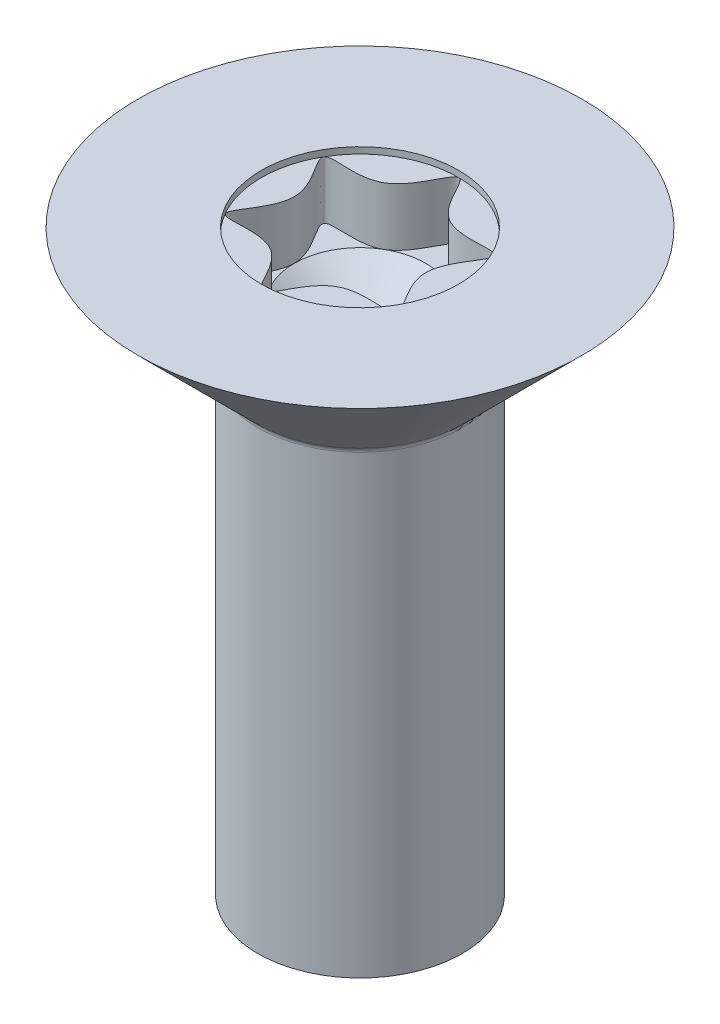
ISO-10303-21;
HEADER;
FILE_DESCRIPTION(('STEP AP214'),'2;1');
FILE_NAME('part.step','',(''),(''),'','','');
FILE_SCHEMA(('AUTOMOTIVE_DESIGN { 1 0 10303 214 1 1 1 1 }'));
ENDSEC;
DATA;
#1=APPLICATION_CONTEXT('core data for automotive mechanical design processes');
#2=APPLICATION_PROTOCOL_DEFINITION('international standard','automotive_design',2000,#1);
#3=PRODUCT_CONTEXT('',#1,'mechanical');
#4=PRODUCT('Part','Part','',(#3));
#5=PRODUCT_RELATED_PRODUCT_CATEGORY('part','',(#4));
#6=PRODUCT_DEFINITION_FORMATION('','',#4);
#7=PRODUCT_DEFINITION_CONTEXT('part definition',#1,'design');
#8=PRODUCT_DEFINITION('design','',#6,#7);
#9=PRODUCT_DEFINITION_SHAPE('','',#8);
#10=(LENGTH_UNIT() NAMED_UNIT(*) SI_UNIT(.MILLI.,.METRE.));
#11=(NAMED_UNIT(*) PLANE_ANGLE_UNIT() SI_UNIT($,.RADIAN.));
#12=(NAMED_UNIT(*) SI_UNIT($,.STERADIAN.) SOLID_ANGLE_UNIT());
#13=UNCERTAINTY_MEASURE_WITH_UNIT(LENGTH_MEASURE(1.E-05),#10,'distance_accuracy_value','');
#14=(GEOMETRIC_REPRESENTATION_CONTEXT(3) GLOBAL_UNCERTAINTY_ASSIGNED_CONTEXT((#13)) GLOBAL_UNIT_ASSIGNED_CONTEXT((#10,
#11,#12)) REPRESENTATION_CONTEXT('',''));
#15=CARTESIAN_POINT('',(0.,0.,0.));
#16=DIRECTION('',(0.,0.,1.));
#17=DIRECTION('',(1.,0.,0.));
#18=AXIS2_PLACEMENT_3D('',#15,#16,#17);
#19=CARTESIAN_POINT('',(0.,7.29,1.4));
#20=DIRECTION('',(0.,1.,0.));
#21=DIRECTION('',(0.,0.,1.));
#22=AXIS2_PLACEMENT_3D('',#19,#20,#21);
#23=PLANE('',#22);
#24=CARTESIAN_POINT('',(0.,7.29,-1.4));
#25=CARTESIAN_POINT('',(0.100650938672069,7.29,-1.4));
#26=CARTESIAN_POINT('',(0.301952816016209,7.29,-0.522997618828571));
#27=CARTESIAN_POINT('',(1.59218873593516,7.29,-0.919250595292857));
#28=CARTESIAN_POINT('',(0.603905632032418,7.29,0.));
#29=CARTESIAN_POINT('',(1.59218873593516,7.29,0.919250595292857));
#30=CARTESIAN_POINT('',(0.301952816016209,7.29,0.52299761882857));
#31=CARTESIAN_POINT('',(0.,7.29,1.83850119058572));
#32=CARTESIAN_POINT('',(-0.301952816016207,7.29,0.522997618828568));
#33=CARTESIAN_POINT('',(-1.59218873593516,7.29,0.919250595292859));
#34=CARTESIAN_POINT('',(-0.603905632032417,7.29,0.));
#35=CARTESIAN_POINT('',(-1.59218873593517,7.29,-0.919250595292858));
#36=CARTESIAN_POINT('',(-0.301952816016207,7.29,-0.52299761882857));
#37=CARTESIAN_POINT('',(-0.100650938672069,7.29,-1.4));
#38=CARTESIAN_POINT('',(0.,7.29,-1.4));
#39=B_SPLINE_CURVE_WITH_KNOTS('',3,(#24,#25,#26,#27,#28,#29,#30,#31,#32,#33,#34,#35,#36,#37,
#38),.UNSPECIFIED.,.T.,.F.,(4,1,1,1,1,1,1,1,1,1,1,1,4),(0.,0.0833333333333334,0.166666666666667,
0.25,0.333333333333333,0.416666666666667,0.5,0.583333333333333,0.666666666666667,0.75,
0.833333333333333,0.916666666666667,1.),.UNSPECIFIED.);
#40=CARTESIAN_POINT('',(0.466666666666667,7.29,-0.808290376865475));
#41=VERTEX_POINT('',#40);
#42=CARTESIAN_POINT('',(0.933333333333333,7.29,0.));
#43=VERTEX_POINT('',#42);
#44=EDGE_CURVE('E133',#41,#43,#39,.T.);
#45=ORIENTED_EDGE('',*,*,#44,.F.);
#46=CARTESIAN_POINT('',(0.,7.29,0.));
#47=DIRECTION('',(0.,-1.,0.));
#48=DIRECTION('',(0.,0.,-1.));
#49=AXIS2_PLACEMENT_3D('',#46,#47,#48);
#50=CIRCLE('',#49,0.933333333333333);
#51=EDGE_CURVE('E48',#41,#43,#50,.T.);
#52=ORIENTED_EDGE('',*,*,#51,.T.);
#53=EDGE_LOOP('',(#45,#52));
#54=FACE_BOUND('',#53,.T.);
#55=ADVANCED_FACE('F33',(#54),#23,.T.);
#56=CARTESIAN_POINT('',(0.466666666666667,7.29,0.808290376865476));
#57=VERTEX_POINT('',#56);
#58=EDGE_CURVE('E148',#43,#57,#39,.T.);
#59=ORIENTED_EDGE('',*,*,#58,.F.);
#60=EDGE_CURVE('E187',#43,#57,#50,.T.);
#61=ORIENTED_EDGE('',*,*,#60,.T.);
#62=EDGE_LOOP('',(#59,#61));
#63=FACE_BOUND('',#62,.T.);
#64=ADVANCED_FACE('F101',(#63),#23,.T.);
#65=CARTESIAN_POINT('',(-0.466666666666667,7.29,0.808290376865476));
#66=VERTEX_POINT('',#65);
#67=EDGE_CURVE('E141',#57,#66,#39,.T.);
#68=ORIENTED_EDGE('',*,*,#67,.F.);
#69=EDGE_CURVE('E190',#57,#66,#50,.T.);
#70=ORIENTED_EDGE('',*,*,#69,.T.);
#71=EDGE_LOOP('',(#68,#70));
#72=FACE_BOUND('',#71,.T.);
#73=ADVANCED_FACE('F108',(#72),#23,.T.);
#74=CARTESIAN_POINT('',(-0.933333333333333,7.29,0.));
#75=VERTEX_POINT('',#74);
#76=EDGE_CURVE('E139',#66,#75,#39,.T.);
#77=ORIENTED_EDGE('',*,*,#76,.F.);
#78=EDGE_CURVE('E195',#66,#75,#50,.T.);
#79=ORIENTED_EDGE('',*,*,#78,.T.);
#80=EDGE_LOOP('',(#77,#79));
#81=FACE_BOUND('',#80,.T.);
#82=ADVANCED_FACE('F122',(#81),#23,.T.);
#83=CARTESIAN_POINT('',(-0.466666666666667,7.29,-0.808290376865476));
#84=VERTEX_POINT('',#83);
#85=EDGE_CURVE('E130',#75,#84,#39,.T.);
#86=ORIENTED_EDGE('',*,*,#85,.F.);
#87=EDGE_CURVE('E198',#75,#84,#50,.T.);
#88=ORIENTED_EDGE('',*,*,#87,.T.);
#89=EDGE_LOOP('',(#86,#88));
#90=FACE_BOUND('',#89,.T.);
#91=ADVANCED_FACE('F114',(#90),#23,.T.);
#92=EDGE_CURVE('E126',#84,#41,#39,.T.);
#93=ORIENTED_EDGE('',*,*,#92,.F.);
#94=EDGE_CURVE('E128',#84,#41,#50,.T.);
#95=ORIENTED_EDGE('',*,*,#94,.T.);
#96=EDGE_LOOP('',(#93,#95));
#97=FACE_BOUND('',#96,.T.);
#98=ADVANCED_FACE('F104',(#97),#23,.T.);
#99=CARTESIAN_POINT('',(0.,8.2,0.));
#100=DIRECTION('',(0.,1.,0.));
#101=DIRECTION('',(0.,0.,1.));
#102=AXIS2_PLACEMENT_3D('',#99,#100,#101);
#103=PLANE('',#102);
#104=CARTESIAN_POINT('',(0.,8.2,0.));
#105=DIRECTION('',(0.,1.,0.));
#106=DIRECTION('',(0.,0.,1.));
#107=AXIS2_PLACEMENT_3D('',#104,#105,#106);
#108=CIRCLE('',#107,1.4);
#109=CARTESIAN_POINT('',(0.,8.2,1.4));
#110=VERTEX_POINT('',#109);
#111=EDGE_CURVE('E149',#110,#110,#108,.T.);
#112=ORIENTED_EDGE('',*,*,#111,.F.);
#113=EDGE_LOOP('',(#112));
#114=FACE_BOUND('',#113,.T.);
#115=CARTESIAN_POINT('',(0.,8.2,0.));
#116=DIRECTION('',(0.,-1.,0.));
#117=DIRECTION('',(0.,0.,-1.));
#118=AXIS2_PLACEMENT_3D('',#115,#116,#117);
#119=CIRCLE('',#118,3.15);
#120=CARTESIAN_POINT('',(0.,8.2,-3.15));
#121=VERTEX_POINT('',#120);
#122=EDGE_CURVE('E173',#121,#121,#119,.T.);
#123=ORIENTED_EDGE('',*,*,#122,.F.);
#124=EDGE_LOOP('',(#123));
#125=FACE_BOUND('',#124,.T.);
#126=ADVANCED_FACE('F113',(#114,#125),#103,.T.);
#127=CARTESIAN_POINT('',(0.,6.5,0.));
#128=DIRECTION('',(0.,1.,0.));
#129=DIRECTION('',(0.,0.,1.));
#130=AXIS2_PLACEMENT_3D('',#127,#128,#129);
#131=CONICAL_SURFACE('',#130,1.44999999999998,0.785398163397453);
#132=CARTESIAN_POINT('',(0.,6.52928932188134,0.));
#133=DIRECTION('',(0.,1.,0.));
#134=DIRECTION('',(0.,0.,1.));
#135=AXIS2_PLACEMENT_3D('',#132,#133,#134);
#136=CIRCLE('',#135,1.47928932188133);
#137=CARTESIAN_POINT('',(0.,6.52928932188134,1.47928932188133));
#138=VERTEX_POINT('',#137);
#139=EDGE_CURVE('E11',#138,#138,#136,.T.);
#140=ORIENTED_EDGE('',*,*,#139,.T.);
#141=EDGE_LOOP('',(#140));
#142=FACE_BOUND('',#141,.T.);
#143=ORIENTED_EDGE('',*,*,#122,.T.);
#144=EDGE_LOOP('',(#143));
#145=FACE_BOUND('',#144,.T.);
#146=ADVANCED_FACE('F120',(#142,#145),#131,.T.);
#147=CARTESIAN_POINT('',(0.,0.,0.));
#148=DIRECTION('',(0.,-1.,0.));
#149=DIRECTION('',(0.,0.,-1.));
#150=AXIS2_PLACEMENT_3D('',#147,#148,#149);
#151=CYLINDRICAL_SURFACE('',#150,1.44999999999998);
#152=CARTESIAN_POINT('',(0.,6.45857864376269,0.));
#153=DIRECTION('',(0.,-1.,0.));
#154=DIRECTION('',(0.,0.,-1.));
#155=AXIS2_PLACEMENT_3D('',#152,#153,#154);
#156=CIRCLE('',#155,1.44999999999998);
#157=CARTESIAN_POINT('',(0.,6.45857864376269,-1.44999999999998));
#158=VERTEX_POINT('',#157);
#159=EDGE_CURVE('E41',#158,#158,#156,.T.);
#160=ORIENTED_EDGE('',*,*,#159,.T.);
#161=EDGE_LOOP('',(#160));
#162=FACE_BOUND('',#161,.T.);
#163=CARTESIAN_POINT('',(0.,0.,0.));
#164=DIRECTION('',(0.,-1.,0.));
#165=DIRECTION('',(0.,0.,-1.));
#166=AXIS2_PLACEMENT_3D('',#163,#164,#165);
#167=CIRCLE('',#166,1.44999999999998);
#168=CARTESIAN_POINT('',(0.,0.,-1.44999999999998));
#169=VERTEX_POINT('',#168);
#170=EDGE_CURVE('E147',#169,#169,#167,.T.);
#171=ORIENTED_EDGE('',*,*,#170,.F.);
#172=EDGE_LOOP('',(#171));
#173=FACE_BOUND('',#172,.T.);
#174=ADVANCED_FACE('F160',(#162,#173),#151,.T.);
#175=CARTESIAN_POINT('',(1.44999999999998,0.,0.));
#176=DIRECTION('',(0.,-1.,0.));
#177=DIRECTION('',(0.,0.,-1.));
#178=AXIS2_PLACEMENT_3D('',#175,#176,#177);
#179=PLANE('',#178);
#180=ORIENTED_EDGE('',*,*,#170,.T.);
#181=EDGE_LOOP('',(#180));
#182=FACE_BOUND('',#181,.T.);
#183=ADVANCED_FACE('F156',(#182),#179,.T.);
#184=CARTESIAN_POINT('',(0.,8.109,0.));
#185=DIRECTION('',(0.,1.,0.));
#186=DIRECTION('',(0.,0.,1.));
#187=AXIS2_PLACEMENT_3D('',#184,#185,#186);
#188=CYLINDRICAL_SURFACE('',#187,1.4);
#189=ORIENTED_EDGE('',*,*,#111,.T.);
#190=EDGE_LOOP('',(#189));
#191=FACE_BOUND('',#190,.T.);
#192=CARTESIAN_POINT('',(0.,8.109,0.));
#193=DIRECTION('',(0.,1.,0.));
#194=DIRECTION('',(0.,0.,1.));
#195=AXIS2_PLACEMENT_3D('',#192,#193,#194);
#196=CIRCLE('',#195,1.4);
#197=CARTESIAN_POINT('',(1.21243556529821,8.109,0.699999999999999));
#198=VERTEX_POINT('',#197);
#199=CARTESIAN_POINT('',(1.21243556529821,8.109,-0.7));
#200=VERTEX_POINT('',#199);
#201=EDGE_CURVE('E212',#198,#200,#196,.T.);
#202=ORIENTED_EDGE('',*,*,#201,.F.);
#203=CARTESIAN_POINT('',(0.,8.109,1.4));
#204=VERTEX_POINT('',#203);
#205=EDGE_CURVE('E131',#204,#198,#196,.T.);
#206=ORIENTED_EDGE('',*,*,#205,.F.);
#207=CARTESIAN_POINT('',(-1.21243556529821,8.109,0.7));
#208=VERTEX_POINT('',#207);
#209=EDGE_CURVE('E197',#208,#204,#196,.T.);
#210=ORIENTED_EDGE('',*,*,#209,.F.);
#211=CARTESIAN_POINT('',(-1.21243556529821,8.109,-0.7));
#212=VERTEX_POINT('',#211);
#213=EDGE_CURVE('E220',#212,#208,#196,.T.);
#214=ORIENTED_EDGE('',*,*,#213,.F.);
#215=CARTESIAN_POINT('',(0.,8.109,-1.4));
#216=VERTEX_POINT('',#215);
#217=EDGE_CURVE('E223',#216,#212,#196,.T.);
#218=ORIENTED_EDGE('',*,*,#217,.F.);
#219=EDGE_CURVE('E55',#200,#216,#196,.T.);
#220=ORIENTED_EDGE('',*,*,#219,.F.);
#221=EDGE_LOOP('',(#202,#206,#210,#214,#218,#220));
#222=FACE_BOUND('',#221,.T.);
#223=ADVANCED_FACE('F159',(#191,#222),#188,.F.);
#224=CARTESIAN_POINT('',(0.,8.109,0.));
#225=DIRECTION('',(0.,1.,0.));
#226=DIRECTION('',(0.,0.,1.));
#227=AXIS2_PLACEMENT_3D('',#224,#225,#226);
#228=PLANE('',#227);
#229=ORIENTED_EDGE('',*,*,#217,.T.);
#230=CARTESIAN_POINT('',(0.,8.109,-1.4));
#231=CARTESIAN_POINT('',(0.100650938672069,8.109,-1.4));
#232=CARTESIAN_POINT('',(0.301952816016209,8.109,-0.522997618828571));
#233=CARTESIAN_POINT('',(1.59218873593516,8.109,-0.919250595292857));
#234=CARTESIAN_POINT('',(0.603905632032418,8.109,0.));
#235=CARTESIAN_POINT('',(1.59218873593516,8.109,0.919250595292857));
#236=CARTESIAN_POINT('',(0.301952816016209,8.109,0.52299761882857));
#237=CARTESIAN_POINT('',(0.,8.109,1.83850119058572));
#238=CARTESIAN_POINT('',(-0.301952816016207,8.109,0.522997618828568));
#239=CARTESIAN_POINT('',(-1.59218873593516,8.109,0.919250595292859));
#240=CARTESIAN_POINT('',(-0.603905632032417,8.109,0.));
#241=CARTESIAN_POINT('',(-1.59218873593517,8.109,-0.919250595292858));
#242=CARTESIAN_POINT('',(-0.301952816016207,8.109,-0.52299761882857));
#243=CARTESIAN_POINT('',(-0.100650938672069,8.109,-1.4));
#244=CARTESIAN_POINT('',(0.,8.109,-1.4));
#245=B_SPLINE_CURVE_WITH_KNOTS('',3,(#230,#231,#232,#233,#234,#235,#236,#237,#238,#239,#240,
#241,#242,#243,#244),.UNSPECIFIED.,.T.,.F.,(4,1,1,1,1,1,1,1,1,1,1,1,4),(0.,0.0833333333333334,
0.166666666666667,0.25,0.333333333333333,0.416666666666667,0.5,0.583333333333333,
0.666666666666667,0.75,0.833333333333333,0.916666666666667,1.),.UNSPECIFIED.);
#246=EDGE_CURVE('E179',#216,#212,#245,.F.);
#247=ORIENTED_EDGE('',*,*,#246,.F.);
#248=EDGE_LOOP('',(#229,#247));
#249=FACE_BOUND('',#248,.T.);
#250=ADVANCED_FACE('F228',(#249),#228,.T.);
#251=ORIENTED_EDGE('',*,*,#213,.T.);
#252=EDGE_CURVE('E200',#212,#208,#245,.F.);
#253=ORIENTED_EDGE('',*,*,#252,.F.);
#254=EDGE_LOOP('',(#251,#253));
#255=FACE_BOUND('',#254,.T.);
#256=ADVANCED_FACE('F230',(#255),#228,.T.);
#257=ORIENTED_EDGE('',*,*,#209,.T.);
#258=EDGE_CURVE('E203',#208,#204,#245,.F.);
#259=ORIENTED_EDGE('',*,*,#258,.F.);
#260=EDGE_LOOP('',(#257,#259));
#261=FACE_BOUND('',#260,.T.);
#262=ADVANCED_FACE('F235',(#261),#228,.T.);
#263=ORIENTED_EDGE('',*,*,#205,.T.);
#264=EDGE_CURVE('E205',#204,#198,#245,.F.);
#265=ORIENTED_EDGE('',*,*,#264,.F.);
#266=EDGE_LOOP('',(#263,#265));
#267=FACE_BOUND('',#266,.T.);
#268=ADVANCED_FACE('F218',(#267),#228,.T.);
#269=ORIENTED_EDGE('',*,*,#201,.T.);
#270=EDGE_CURVE('E177',#198,#200,#245,.F.);
#271=ORIENTED_EDGE('',*,*,#270,.F.);
#272=EDGE_LOOP('',(#269,#271));
#273=FACE_BOUND('',#272,.T.);
#274=ADVANCED_FACE('F211',(#273),#228,.T.);
#275=ORIENTED_EDGE('',*,*,#219,.T.);
#276=EDGE_CURVE('E175',#200,#216,#245,.F.);
#277=ORIENTED_EDGE('',*,*,#276,.F.);
#278=EDGE_LOOP('',(#275,#277));
#279=FACE_BOUND('',#278,.T.);
#280=ADVANCED_FACE('F96',(#279),#228,.T.);
#281=DIRECTION('',(0.,1.,0.));
#282=VECTOR('',#281,1.);
#283=SURFACE_OF_LINEAR_EXTRUSION('',#39,#282);
#284=ORIENTED_EDGE('',*,*,#44,.T.);
#285=ORIENTED_EDGE('',*,*,#58,.T.);
#286=ORIENTED_EDGE('',*,*,#67,.T.);
#287=ORIENTED_EDGE('',*,*,#76,.T.);
#288=ORIENTED_EDGE('',*,*,#85,.T.);
#289=ORIENTED_EDGE('',*,*,#92,.T.);
#290=EDGE_LOOP('',(#284,#285,#286,#287,#288,#289));
#291=FACE_BOUND('',#290,.T.);
#292=ORIENTED_EDGE('',*,*,#276,.T.);
#293=ORIENTED_EDGE('',*,*,#246,.T.);
#294=ORIENTED_EDGE('',*,*,#252,.T.);
#295=ORIENTED_EDGE('',*,*,#258,.T.);
#296=ORIENTED_EDGE('',*,*,#264,.T.);
#297=ORIENTED_EDGE('',*,*,#270,.T.);
#298=EDGE_LOOP('',(#292,#293,#294,#295,#296,#297));
#299=FACE_BOUND('',#298,.T.);
#300=ADVANCED_FACE('F89',(#291,#299),#283,.T.);
#301=CARTESIAN_POINT('',(0.,6.67,0.));
#302=DIRECTION('',(0.,1.,0.));
#303=DIRECTION('',(0.,0.,1.));
#304=AXIS2_PLACEMENT_3D('',#301,#302,#303);
#305=CONICAL_SURFACE('',#304,0.,0.984443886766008);
#306=ORIENTED_EDGE('',*,*,#51,.F.);
#307=ORIENTED_EDGE('',*,*,#94,.F.);
#308=ORIENTED_EDGE('',*,*,#87,.F.);
#309=ORIENTED_EDGE('',*,*,#78,.F.);
#310=ORIENTED_EDGE('',*,*,#69,.F.);
#311=ORIENTED_EDGE('',*,*,#60,.F.);
#312=EDGE_LOOP('',(#306,#307,#308,#309,#310,#311));
#313=FACE_BOUND('',#312,.T.);
#314=CARTESIAN_POINT('',(0.,6.67,0.));
#315=VERTEX_POINT('',#314);
#316=VERTEX_LOOP('',#315);
#317=FACE_BOUND('',#316,.T.);
#318=ADVANCED_FACE('F87',(#313,#317),#305,.F.);
#319=CARTESIAN_POINT('',(0.,6.45857864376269,0.));
#320=DIRECTION('',(0.,-1.,0.));
#321=DIRECTION('',(0.,0.,-1.));
#322=AXIS2_PLACEMENT_3D('',#319,#320,#321);
#323=TOROIDAL_SURFACE('',#322,1.54999999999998,0.1);
#324=ORIENTED_EDGE('',*,*,#139,.F.);
#325=EDGE_LOOP('',(#324));
#326=FACE_BOUND('',#325,.T.);
#327=ORIENTED_EDGE('',*,*,#159,.F.);
#328=EDGE_LOOP('',(#327));
#329=FACE_BOUND('',#328,.T.);
#330=ADVANCED_FACE('F35',(#326,#329),#323,.F.);
#331=CLOSED_SHELL('',(#55,#64,#73,#82,#91,#98,#126,#146,#174,#183,#223,#250,#256,#262,#268,#274,
#280,#300,#318,#330));
#332=MANIFOLD_SOLID_BREP('B2',#331);
#333=ADVANCED_BREP_SHAPE_REPRESENTATION('',(#18,#332),#14);
#334=SHAPE_DEFINITION_REPRESENTATION(#9,#333);
ENDSEC;
END-ISO-10303-21;
